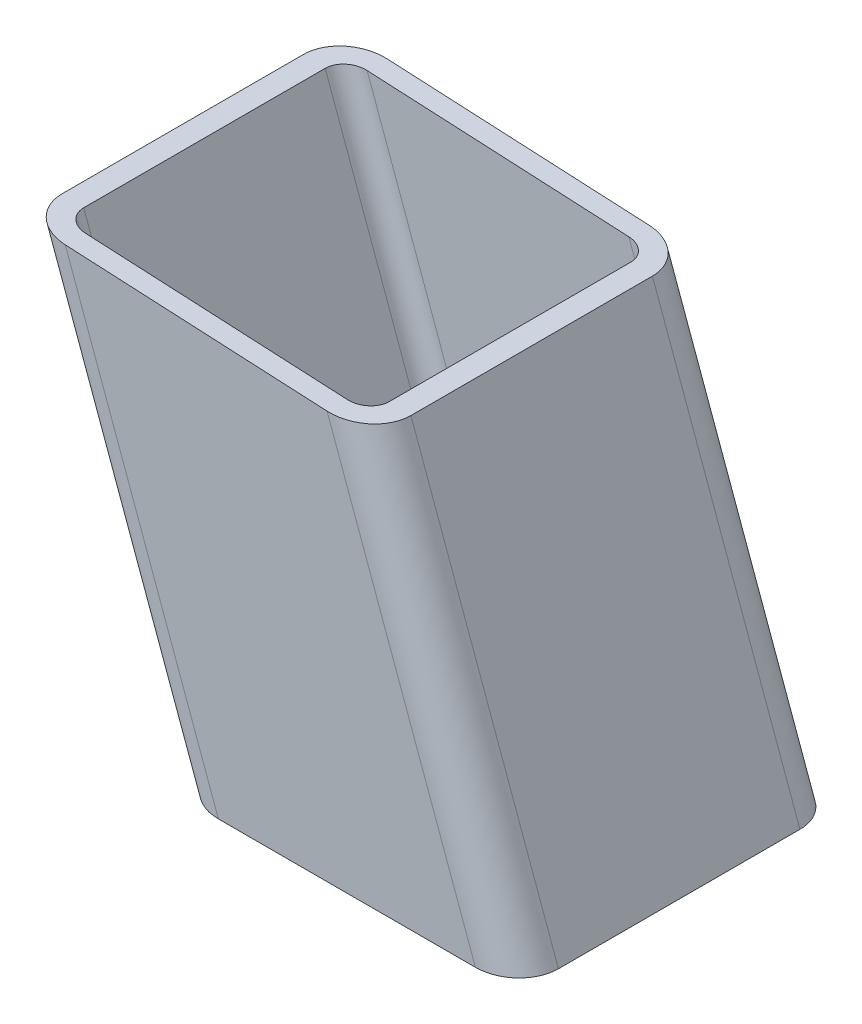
ISO-10303-21;
HEADER;
FILE_DESCRIPTION(('STEP AP214'),'2;1');
FILE_NAME('part.step','',(''),(''),'','','');
FILE_SCHEMA(('AUTOMOTIVE_DESIGN { 1 0 10303 214 1 1 1 1 }'));
ENDSEC;
DATA;
#1=APPLICATION_CONTEXT('core data for automotive mechanical design processes');
#2=APPLICATION_PROTOCOL_DEFINITION('international standard','automotive_design',2000,#1);
#3=PRODUCT_CONTEXT('',#1,'mechanical');
#4=PRODUCT('Part','Part','',(#3));
#5=PRODUCT_RELATED_PRODUCT_CATEGORY('part','',(#4));
#6=PRODUCT_DEFINITION_FORMATION('','',#4);
#7=PRODUCT_DEFINITION_CONTEXT('part definition',#1,'design');
#8=PRODUCT_DEFINITION('design','',#6,#7);
#9=PRODUCT_DEFINITION_SHAPE('','',#8);
#10=(LENGTH_UNIT() NAMED_UNIT(*) SI_UNIT(.MILLI.,.METRE.));
#11=(NAMED_UNIT(*) PLANE_ANGLE_UNIT() SI_UNIT($,.RADIAN.));
#12=(NAMED_UNIT(*) SI_UNIT($,.STERADIAN.) SOLID_ANGLE_UNIT());
#13=UNCERTAINTY_MEASURE_WITH_UNIT(LENGTH_MEASURE(1.E-05),#10,'distance_accuracy_value','');
#14=(GEOMETRIC_REPRESENTATION_CONTEXT(3) GLOBAL_UNCERTAINTY_ASSIGNED_CONTEXT((#13)) GLOBAL_UNIT_ASSIGNED_CONTEXT((#10,
#11,#12)) REPRESENTATION_CONTEXT('',''));
#15=CARTESIAN_POINT('',(0.,0.,0.));
#16=DIRECTION('',(0.,0.,1.));
#17=DIRECTION('',(1.,0.,0.));
#18=AXIS2_PLACEMENT_3D('',#15,#16,#17);
#19=CARTESIAN_POINT('',(4200.10402120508,13.6808057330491,30.));
#20=DIRECTION('',(-0.939692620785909,-0.342020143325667,0.));
#21=DIRECTION('',(0.342020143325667,-0.939692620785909,0.));
#22=AXIS2_PLACEMENT_3D('',#19,#20,#21);
#23=PLANE('',#22);
#24=DIRECTION('',(0.,0.,1.));
#25=VECTOR('',#24,1.);
#26=CARTESIAN_POINT('',(4184.33712391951,56.9999999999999,30.0000000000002));
#27=LINE('',#26,#25);
#28=CARTESIAN_POINT('',(4184.33712391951,57.,-30.));
#29=VERTEX_POINT('',#28);
#30=CARTESIAN_POINT('',(4184.33712391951,56.9999999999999,30.));
#31=VERTEX_POINT('',#30);
#32=EDGE_CURVE('E53',#29,#31,#27,.T.);
#33=ORIENTED_EDGE('',*,*,#32,.F.);
#34=DIRECTION('',(-0.342020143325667,0.939692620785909,0.));
#35=VECTOR('',#34,1.);
#36=CARTESIAN_POINT('',(4200.10402120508,13.6808057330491,-30.));
#37=LINE('',#36,#35);
#38=CARTESIAN_POINT('',(4147.67799517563,157.720128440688,-30.));
#39=VERTEX_POINT('',#38);
#40=EDGE_CURVE('E38',#29,#39,#37,.T.);
#41=ORIENTED_EDGE('',*,*,#40,.T.);
#42=DIRECTION('',(0.,0.,-1.));
#43=VECTOR('',#42,1.);
#44=CARTESIAN_POINT('',(4147.67799517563,157.720128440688,30.));
#45=LINE('',#44,#43);
#46=CARTESIAN_POINT('',(4147.67799517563,157.720128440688,30.));
#47=VERTEX_POINT('',#46);
#48=EDGE_CURVE('E107',#47,#39,#45,.T.);
#49=ORIENTED_EDGE('',*,*,#48,.F.);
#50=DIRECTION('',(-0.342020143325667,0.939692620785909,0.));
#51=VECTOR('',#50,1.);
#52=CARTESIAN_POINT('',(4200.10402120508,13.6808057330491,30.));
#53=LINE('',#52,#51);
#54=EDGE_CURVE('E185',#31,#47,#53,.T.);
#55=ORIENTED_EDGE('',*,*,#54,.F.);
#56=EDGE_LOOP('',(#33,#41,#49,#55));
#57=FACE_BOUND('',#56,.T.);
#58=ADVANCED_FACE('F34',(#57),#23,.F.);
#59=CARTESIAN_POINT('',(4190.70709499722,10.2606042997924,-30.));
#60=DIRECTION('',(-0.342020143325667,0.939692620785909,0.));
#61=DIRECTION('',(-0.939692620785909,-0.342020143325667,0.));
#62=AXIS2_PLACEMENT_3D('',#59,#60,#61);
#63=CYLINDRICAL_SURFACE('',#62,10.);
#64=CARTESIAN_POINT('',(4173.69534619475,57.0000000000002,-30.));
#65=DIRECTION('',(0.,-1.,0.));
#66=DIRECTION('',(-1.,0.,0.));
#67=AXIS2_PLACEMENT_3D('',#64,#65,#66);
#68=ELLIPSE('',#67,10.6417777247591,10.);
#69=CARTESIAN_POINT('',(4173.69534619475,57.0000000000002,-40.));
#70=VERTEX_POINT('',#69);
#71=EDGE_CURVE('E155',#70,#29,#68,.T.);
#72=ORIENTED_EDGE('',*,*,#71,.F.);
#73=DIRECTION('',(-0.342020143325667,0.939692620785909,0.));
#74=VECTOR('',#73,1.);
#75=CARTESIAN_POINT('',(4190.70709499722,10.2606042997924,-40.));
#76=LINE('',#75,#74);
#77=CARTESIAN_POINT('',(4136.83868869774,158.262834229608,-40.));
#78=VERTEX_POINT('',#77);
#79=EDGE_CURVE('E165',#70,#78,#76,.T.);
#80=ORIENTED_EDGE('',*,*,#79,.T.);
#81=CARTESIAN_POINT('',(4136.83868869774,158.262834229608,-30.));
#82=DIRECTION('',(0.0500056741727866,0.998748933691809,0.));
#83=DIRECTION('',(-0.998748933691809,0.0500056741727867,0.));
#84=AXIS2_PLACEMENT_3D('',#81,#82,#83);
#85=ELLIPSE('',#84,10.8528841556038,10.);
#86=EDGE_CURVE('E102',#39,#78,#85,.T.);
#87=ORIENTED_EDGE('',*,*,#86,.F.);
#88=ORIENTED_EDGE('',*,*,#40,.F.);
#89=EDGE_LOOP('',(#72,#80,#87,#88));
#90=FACE_BOUND('',#89,.T.);
#91=ADVANCED_FACE('F164',(#90),#63,.T.);
#92=CARTESIAN_POINT('',(4134.32553775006,-10.2606042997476,-40.));
#93=DIRECTION('',(0.,0.,1.));
#94=DIRECTION('',(1.,0.,0.));
#95=AXIS2_PLACEMENT_3D('',#92,#93,#94);
#96=PLANE('',#95);
#97=DIRECTION('',(1.,0.,0.));
#98=VECTOR('',#97,1.);
#99=CARTESIAN_POINT('',(4134.32553775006,57.0000000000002,-40.));
#100=LINE('',#99,#98);
#101=CARTESIAN_POINT('',(4109.8446798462,57.0000000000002,-40.));
#102=VERTEX_POINT('',#101);
#103=EDGE_CURVE('E152',#102,#70,#100,.T.);
#104=ORIENTED_EDGE('',*,*,#103,.F.);
#105=DIRECTION('',(-0.342020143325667,0.939692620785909,0.));
#106=VECTOR('',#105,1.);
#107=CARTESIAN_POINT('',(4134.32553775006,-10.2606042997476,-40.));
#108=LINE('',#107,#106);
#109=CARTESIAN_POINT('',(4071.8028498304,161.519068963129,-40.));
#110=VERTEX_POINT('',#109);
#111=EDGE_CURVE('E170',#102,#110,#108,.T.);
#112=ORIENTED_EDGE('',*,*,#111,.T.);
#113=DIRECTION('',(-0.998748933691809,0.0500056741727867,0.));
#114=VECTOR('',#113,1.);
#115=CARTESIAN_POINT('',(4142.74840731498,157.966944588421,-40.));
#116=LINE('',#115,#114);
#117=EDGE_CURVE('E169',#78,#110,#116,.T.);
#118=ORIENTED_EDGE('',*,*,#117,.F.);
#119=ORIENTED_EDGE('',*,*,#79,.F.);
#120=EDGE_LOOP('',(#104,#112,#118,#119));
#121=FACE_BOUND('',#120,.T.);
#122=ADVANCED_FACE('F168',(#121),#96,.F.);
#123=CARTESIAN_POINT('',(4134.32553775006,-10.2606042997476,-30.));
#124=DIRECTION('',(-0.342020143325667,0.939692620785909,0.));
#125=DIRECTION('',(-0.939692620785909,-0.342020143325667,0.));
#126=AXIS2_PLACEMENT_3D('',#123,#124,#125);
#127=CYLINDRICAL_SURFACE('',#126,10.);
#128=CARTESIAN_POINT('',(4109.8446798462,57.0000000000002,-30.));
#129=DIRECTION('',(0.,-1.,0.));
#130=DIRECTION('',(-1.,0.,0.));
#131=AXIS2_PLACEMENT_3D('',#128,#129,#130);
#132=ELLIPSE('',#131,10.6417777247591,10.);
#133=CARTESIAN_POINT('',(4099.20290212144,57.0000000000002,-30.));
#134=VERTEX_POINT('',#133);
#135=EDGE_CURVE('E150',#134,#102,#132,.T.);
#136=ORIENTED_EDGE('',*,*,#135,.F.);
#137=DIRECTION('',(-0.342020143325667,0.939692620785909,0.));
#138=VECTOR('',#137,1.);
#139=CARTESIAN_POINT('',(4124.9286115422,-13.6808057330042,-30.));
#140=LINE('',#139,#138);
#141=CARTESIAN_POINT('',(4060.96354335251,162.061774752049,-30.));
#142=VERTEX_POINT('',#141);
#143=EDGE_CURVE('E171',#134,#142,#140,.T.);
#144=ORIENTED_EDGE('',*,*,#143,.T.);
#145=CARTESIAN_POINT('',(4071.8028498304,161.519068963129,-30.));
#146=DIRECTION('',(0.0500056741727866,0.998748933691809,0.));
#147=DIRECTION('',(-0.998748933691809,0.0500056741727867,0.));
#148=AXIS2_PLACEMENT_3D('',#145,#146,#147);
#149=ELLIPSE('',#148,10.8528841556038,10.);
#150=EDGE_CURVE('E228',#110,#142,#149,.T.);
#151=ORIENTED_EDGE('',*,*,#150,.F.);
#152=ORIENTED_EDGE('',*,*,#111,.F.);
#153=EDGE_LOOP('',(#136,#144,#151,#152));
#154=FACE_BOUND('',#153,.T.);
#155=ADVANCED_FACE('F325',(#154),#127,.T.);
#156=CARTESIAN_POINT('',(4124.9286115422,-13.6808057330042,-30.));
#157=DIRECTION('',(0.939692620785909,0.342020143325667,0.));
#158=DIRECTION('',(-0.342020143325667,0.939692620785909,0.));
#159=AXIS2_PLACEMENT_3D('',#156,#157,#158);
#160=PLANE('',#159);
#161=DIRECTION('',(0.,0.,-1.));
#162=VECTOR('',#161,1.);
#163=CARTESIAN_POINT('',(4099.20290212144,57.0000000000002,-29.9999999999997));
#164=LINE('',#163,#162);
#165=CARTESIAN_POINT('',(4099.20290212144,56.9999999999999,30.));
#166=VERTEX_POINT('',#165);
#167=EDGE_CURVE('E253',#166,#134,#164,.T.);
#168=ORIENTED_EDGE('',*,*,#167,.F.);
#169=DIRECTION('',(-0.342020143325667,0.939692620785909,0.));
#170=VECTOR('',#169,1.);
#171=CARTESIAN_POINT('',(4124.9286115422,-13.6808057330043,30.));
#172=LINE('',#171,#170);
#173=CARTESIAN_POINT('',(4060.96354335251,162.061774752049,30.));
#174=VERTEX_POINT('',#173);
#175=EDGE_CURVE('E176',#166,#174,#172,.T.);
#176=ORIENTED_EDGE('',*,*,#175,.T.);
#177=DIRECTION('',(0.,0.,1.));
#178=VECTOR('',#177,1.);
#179=CARTESIAN_POINT('',(4060.96354335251,162.061774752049,-30.0000000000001));
#180=LINE('',#179,#178);
#181=EDGE_CURVE('E230',#142,#174,#180,.T.);
#182=ORIENTED_EDGE('',*,*,#181,.F.);
#183=ORIENTED_EDGE('',*,*,#143,.F.);
#184=EDGE_LOOP('',(#168,#176,#182,#183));
#185=FACE_BOUND('',#184,.T.);
#186=ADVANCED_FACE('F328',(#185),#160,.F.);
#187=CARTESIAN_POINT('',(4134.32553775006,-10.2606042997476,30.));
#188=DIRECTION('',(-0.342020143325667,0.939692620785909,0.));
#189=DIRECTION('',(-0.939692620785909,-0.342020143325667,0.));
#190=AXIS2_PLACEMENT_3D('',#187,#188,#189);
#191=CYLINDRICAL_SURFACE('',#190,10.);
#192=CARTESIAN_POINT('',(4109.8446798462,56.9999999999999,30.));
#193=DIRECTION('',(0.,-1.,0.));
#194=DIRECTION('',(-1.,0.,0.));
#195=AXIS2_PLACEMENT_3D('',#192,#193,#194);
#196=ELLIPSE('',#195,10.6417777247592,10.);
#197=CARTESIAN_POINT('',(4109.8446798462,56.9999999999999,40.));
#198=VERTEX_POINT('',#197);
#199=EDGE_CURVE('E255',#198,#166,#196,.T.);
#200=ORIENTED_EDGE('',*,*,#199,.F.);
#201=DIRECTION('',(-0.342020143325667,0.939692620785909,0.));
#202=VECTOR('',#201,1.);
#203=CARTESIAN_POINT('',(4134.32553775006,-10.2606042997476,40.));
#204=LINE('',#203,#202);
#205=CARTESIAN_POINT('',(4071.8028498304,161.519068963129,40.));
#206=VERTEX_POINT('',#205);
#207=EDGE_CURVE('E179',#198,#206,#204,.T.);
#208=ORIENTED_EDGE('',*,*,#207,.T.);
#209=CARTESIAN_POINT('',(4071.8028498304,161.519068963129,30.));
#210=DIRECTION('',(0.0500056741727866,0.998748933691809,0.));
#211=DIRECTION('',(-0.998748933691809,0.0500056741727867,0.));
#212=AXIS2_PLACEMENT_3D('',#209,#210,#211);
#213=ELLIPSE('',#212,10.8528841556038,10.);
#214=EDGE_CURVE('E232',#174,#206,#213,.T.);
#215=ORIENTED_EDGE('',*,*,#214,.F.);
#216=ORIENTED_EDGE('',*,*,#175,.F.);
#217=EDGE_LOOP('',(#200,#208,#215,#216));
#218=FACE_BOUND('',#217,.T.);
#219=ADVANCED_FACE('F332',(#218),#191,.T.);
#220=CARTESIAN_POINT('',(4190.70709499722,10.2606042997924,40.));
#221=DIRECTION('',(0.,0.,-1.));
#222=DIRECTION('',(-1.,0.,0.));
#223=AXIS2_PLACEMENT_3D('',#220,#221,#222);
#224=PLANE('',#223);
#225=DIRECTION('',(-1.,0.,0.));
#226=VECTOR('',#225,1.);
#227=CARTESIAN_POINT('',(4190.70709499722,56.9999999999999,40.));
#228=LINE('',#227,#226);
#229=CARTESIAN_POINT('',(4173.69534619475,56.9999999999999,40.));
#230=VERTEX_POINT('',#229);
#231=EDGE_CURVE('E257',#230,#198,#228,.T.);
#232=ORIENTED_EDGE('',*,*,#231,.F.);
#233=DIRECTION('',(-0.342020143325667,0.939692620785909,0.));
#234=VECTOR('',#233,1.);
#235=CARTESIAN_POINT('',(4190.70709499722,10.2606042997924,40.));
#236=LINE('',#235,#234);
#237=CARTESIAN_POINT('',(4136.83868869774,158.262834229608,40.));
#238=VERTEX_POINT('',#237);
#239=EDGE_CURVE('E182',#230,#238,#236,.T.);
#240=ORIENTED_EDGE('',*,*,#239,.T.);
#241=DIRECTION('',(0.998748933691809,-0.0500056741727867,0.));
#242=VECTOR('',#241,1.);
#243=CARTESIAN_POINT('',(4197.96408561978,155.202388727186,40.));
#244=LINE('',#243,#242);
#245=EDGE_CURVE('E234',#206,#238,#244,.T.);
#246=ORIENTED_EDGE('',*,*,#245,.F.);
#247=ORIENTED_EDGE('',*,*,#207,.F.);
#248=EDGE_LOOP('',(#232,#240,#246,#247));
#249=FACE_BOUND('',#248,.T.);
#250=ADVANCED_FACE('F335',(#249),#224,.F.);
#251=CARTESIAN_POINT('',(4190.70709499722,10.2606042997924,30.));
#252=DIRECTION('',(-0.342020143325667,0.939692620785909,0.));
#253=DIRECTION('',(-0.939692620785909,-0.342020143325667,0.));
#254=AXIS2_PLACEMENT_3D('',#251,#252,#253);
#255=CYLINDRICAL_SURFACE('',#254,10.);
#256=CARTESIAN_POINT('',(4173.69534619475,56.9999999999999,30.));
#257=DIRECTION('',(0.,-1.,0.));
#258=DIRECTION('',(-1.,0.,0.));
#259=AXIS2_PLACEMENT_3D('',#256,#257,#258);
#260=ELLIPSE('',#259,10.6417777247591,10.);
#261=EDGE_CURVE('E236',#31,#230,#260,.T.);
#262=ORIENTED_EDGE('',*,*,#261,.F.);
#263=ORIENTED_EDGE('',*,*,#54,.T.);
#264=CARTESIAN_POINT('',(4136.83868869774,158.262834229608,30.));
#265=DIRECTION('',(0.0500056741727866,0.998748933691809,0.));
#266=DIRECTION('',(-0.998748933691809,0.0500056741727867,0.));
#267=AXIS2_PLACEMENT_3D('',#264,#265,#266);
#268=ELLIPSE('',#267,10.8528841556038,10.);
#269=EDGE_CURVE('E110',#238,#47,#268,.T.);
#270=ORIENTED_EDGE('',*,*,#269,.F.);
#271=ORIENTED_EDGE('',*,*,#239,.F.);
#272=EDGE_LOOP('',(#262,#263,#270,#271));
#273=FACE_BOUND('',#272,.T.);
#274=ADVANCED_FACE('F36',(#273),#255,.T.);
#275=CARTESIAN_POINT('',(6158.08276398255,57.0625533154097,-40.));
#276=DIRECTION('',(0.0500056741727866,0.998748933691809,0.));
#277=DIRECTION('',(-0.998748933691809,0.0500056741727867,0.));
#278=AXIS2_PLACEMENT_3D('',#275,#276,#277);
#279=PLANE('',#278);
#280=DIRECTION('',(0.,0.,1.));
#281=VECTOR('',#280,1.);
#282=CARTESIAN_POINT('',(4066.38319659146,161.790421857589,-30.));
#283=LINE('',#282,#281);
#284=CARTESIAN_POINT('',(4066.38319659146,161.790421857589,-30.));
#285=VERTEX_POINT('',#284);
#286=CARTESIAN_POINT('',(4066.38319659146,161.790421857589,30.));
#287=VERTEX_POINT('',#286);
#288=EDGE_CURVE('E191',#285,#287,#283,.T.);
#289=ORIENTED_EDGE('',*,*,#288,.F.);
#290=CARTESIAN_POINT('',(4071.8028498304,161.519068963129,-30.));
#291=DIRECTION('',(0.0500056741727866,0.998748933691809,0.));
#292=DIRECTION('',(-0.998748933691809,0.0500056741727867,0.));
#293=AXIS2_PLACEMENT_3D('',#290,#291,#292);
#294=ELLIPSE('',#293,5.4264420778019,5.00000000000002);
#295=CARTESIAN_POINT('',(4071.8028498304,161.519068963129,-35.));
#296=VERTEX_POINT('',#295);
#297=EDGE_CURVE('E196',#296,#285,#294,.T.);
#298=ORIENTED_EDGE('',*,*,#297,.F.);
#299=DIRECTION('',(-0.998748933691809,0.0500056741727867,0.));
#300=VECTOR('',#299,1.);
#301=CARTESIAN_POINT('',(4142.74840731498,157.966944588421,-35.));
#302=LINE('',#301,#300);
#303=CARTESIAN_POINT('',(4136.83868869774,158.262834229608,-35.));
#304=VERTEX_POINT('',#303);
#305=EDGE_CURVE('E201',#304,#296,#302,.T.);
#306=ORIENTED_EDGE('',*,*,#305,.F.);
#307=CARTESIAN_POINT('',(4136.83868869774,158.262834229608,-30.));
#308=DIRECTION('',(0.0500056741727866,0.998748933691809,0.));
#309=DIRECTION('',(-0.998748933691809,0.0500056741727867,0.));
#310=AXIS2_PLACEMENT_3D('',#307,#308,#309);
#311=ELLIPSE('',#310,5.4264420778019,5.00000000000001);
#312=CARTESIAN_POINT('',(4142.25834193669,157.991481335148,-30.));
#313=VERTEX_POINT('',#312);
#314=EDGE_CURVE('E206',#313,#304,#311,.T.);
#315=ORIENTED_EDGE('',*,*,#314,.F.);
#316=DIRECTION('',(0.,0.,-1.));
#317=VECTOR('',#316,1.);
#318=CARTESIAN_POINT('',(4142.25834193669,157.991481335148,30.));
#319=LINE('',#318,#317);
#320=CARTESIAN_POINT('',(4142.25834193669,157.991481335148,30.));
#321=VERTEX_POINT('',#320);
#322=EDGE_CURVE('E211',#321,#313,#319,.T.);
#323=ORIENTED_EDGE('',*,*,#322,.F.);
#324=CARTESIAN_POINT('',(4136.83868869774,158.262834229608,30.));
#325=DIRECTION('',(0.0500056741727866,0.998748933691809,0.));
#326=DIRECTION('',(-0.998748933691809,0.0500056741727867,0.));
#327=AXIS2_PLACEMENT_3D('',#324,#325,#326);
#328=ELLIPSE('',#327,5.4264420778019,5.00000000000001);
#329=CARTESIAN_POINT('',(4136.83868869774,158.262834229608,35.));
#330=VERTEX_POINT('',#329);
#331=EDGE_CURVE('E216',#330,#321,#328,.T.);
#332=ORIENTED_EDGE('',*,*,#331,.F.);
#333=DIRECTION('',(0.998748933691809,-0.0500056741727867,0.));
#334=VECTOR('',#333,1.);
#335=CARTESIAN_POINT('',(4197.96408561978,155.202388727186,35.));
#336=LINE('',#335,#334);
#337=CARTESIAN_POINT('',(4071.8028498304,161.519068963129,35.));
#338=VERTEX_POINT('',#337);
#339=EDGE_CURVE('E221',#338,#330,#336,.T.);
#340=ORIENTED_EDGE('',*,*,#339,.F.);
#341=CARTESIAN_POINT('',(4071.8028498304,161.519068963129,30.));
#342=DIRECTION('',(0.0500056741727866,0.998748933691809,0.));
#343=DIRECTION('',(-0.998748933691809,0.0500056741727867,0.));
#344=AXIS2_PLACEMENT_3D('',#341,#342,#343);
#345=ELLIPSE('',#344,5.42644207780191,5.00000000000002);
#346=EDGE_CURVE('E11',#287,#338,#345,.T.);
#347=ORIENTED_EDGE('',*,*,#346,.F.);
#348=EDGE_LOOP('',(#289,#298,#306,#315,#323,#332,#340,#347));
#349=FACE_BOUND('',#348,.T.);
#350=ORIENTED_EDGE('',*,*,#269,.T.);
#351=ORIENTED_EDGE('',*,*,#48,.T.);
#352=ORIENTED_EDGE('',*,*,#86,.T.);
#353=ORIENTED_EDGE('',*,*,#117,.T.);
#354=ORIENTED_EDGE('',*,*,#150,.T.);
#355=ORIENTED_EDGE('',*,*,#181,.T.);
#356=ORIENTED_EDGE('',*,*,#214,.T.);
#357=ORIENTED_EDGE('',*,*,#245,.T.);
#358=EDGE_LOOP('',(#350,#351,#352,#353,#354,#355,#356,#357));
#359=FACE_BOUND('',#358,.T.);
#360=ADVANCED_FACE('F286',(#349,#359),#279,.T.);
#361=CARTESIAN_POINT('',(9149.96897120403,57.0000000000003,-59.9999999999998));
#362=DIRECTION('',(0.,-1.,0.));
#363=DIRECTION('',(0.,0.,-1.));
#364=AXIS2_PLACEMENT_3D('',#361,#362,#363);
#365=PLANE('',#364);
#366=DIRECTION('',(-1.,0.,0.));
#367=VECTOR('',#366,1.);
#368=CARTESIAN_POINT('',(4190.70709499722,56.9999999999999,35.));
#369=LINE('',#368,#367);
#370=CARTESIAN_POINT('',(4173.69534619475,56.9999999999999,35.));
#371=VERTEX_POINT('',#370);
#372=CARTESIAN_POINT('',(4109.8446798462,56.9999999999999,35.));
#373=VERTEX_POINT('',#372);
#374=EDGE_CURVE('E222',#371,#373,#369,.T.);
#375=ORIENTED_EDGE('',*,*,#374,.F.);
#376=CARTESIAN_POINT('',(4173.69534619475,56.9999999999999,30.));
#377=DIRECTION('',(0.,-1.,0.));
#378=DIRECTION('',(-1.,0.,0.));
#379=AXIS2_PLACEMENT_3D('',#376,#377,#378);
#380=ELLIPSE('',#379,5.32088886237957,5.00000000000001);
#381=CARTESIAN_POINT('',(4179.01623505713,56.9999999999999,30.));
#382=VERTEX_POINT('',#381);
#383=EDGE_CURVE('E217',#382,#371,#380,.T.);
#384=ORIENTED_EDGE('',*,*,#383,.F.);
#385=DIRECTION('',(0.,0.,1.));
#386=VECTOR('',#385,1.);
#387=CARTESIAN_POINT('',(4179.01623505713,56.9999999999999,30.0000000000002));
#388=LINE('',#387,#386);
#389=CARTESIAN_POINT('',(4179.01623505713,57.0000000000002,-30.));
#390=VERTEX_POINT('',#389);
#391=EDGE_CURVE('E212',#390,#382,#388,.T.);
#392=ORIENTED_EDGE('',*,*,#391,.F.);
#393=CARTESIAN_POINT('',(4173.69534619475,57.0000000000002,-30.));
#394=DIRECTION('',(0.,-1.,0.));
#395=DIRECTION('',(-1.,0.,0.));
#396=AXIS2_PLACEMENT_3D('',#393,#394,#395);
#397=ELLIPSE('',#396,5.32088886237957,5.00000000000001);
#398=CARTESIAN_POINT('',(4173.69534619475,57.0000000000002,-35.));
#399=VERTEX_POINT('',#398);
#400=EDGE_CURVE('E207',#399,#390,#397,.T.);
#401=ORIENTED_EDGE('',*,*,#400,.F.);
#402=DIRECTION('',(1.,0.,0.));
#403=VECTOR('',#402,1.);
#404=CARTESIAN_POINT('',(4134.32553775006,57.0000000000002,-35.));
#405=LINE('',#404,#403);
#406=CARTESIAN_POINT('',(4109.8446798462,57.0000000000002,-35.));
#407=VERTEX_POINT('',#406);
#408=EDGE_CURVE('E202',#407,#399,#405,.T.);
#409=ORIENTED_EDGE('',*,*,#408,.F.);
#410=CARTESIAN_POINT('',(4109.8446798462,57.0000000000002,-30.));
#411=DIRECTION('',(0.,-1.,0.));
#412=DIRECTION('',(-1.,0.,0.));
#413=AXIS2_PLACEMENT_3D('',#410,#411,#412);
#414=ELLIPSE('',#413,5.32088886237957,5.00000000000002);
#415=CARTESIAN_POINT('',(4104.52379098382,57.0000000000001,-30.));
#416=VERTEX_POINT('',#415);
#417=EDGE_CURVE('E197',#416,#407,#414,.T.);
#418=ORIENTED_EDGE('',*,*,#417,.F.);
#419=DIRECTION('',(0.,0.,-1.));
#420=VECTOR('',#419,1.);
#421=CARTESIAN_POINT('',(4104.52379098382,57.0000000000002,-29.9999999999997));
#422=LINE('',#421,#420);
#423=CARTESIAN_POINT('',(4104.52379098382,56.9999999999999,30.));
#424=VERTEX_POINT('',#423);
#425=EDGE_CURVE('E192',#424,#416,#422,.T.);
#426=ORIENTED_EDGE('',*,*,#425,.F.);
#427=CARTESIAN_POINT('',(4109.8446798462,56.9999999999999,30.));
#428=DIRECTION('',(0.,-1.,0.));
#429=DIRECTION('',(-1.,0.,0.));
#430=AXIS2_PLACEMENT_3D('',#427,#428,#429);
#431=ELLIPSE('',#430,5.32088886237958,5.00000000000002);
#432=EDGE_CURVE('E225',#373,#424,#431,.T.);
#433=ORIENTED_EDGE('',*,*,#432,.F.);
#434=EDGE_LOOP('',(#375,#384,#392,#401,#409,#418,#426,#433));
#435=FACE_BOUND('',#434,.T.);
#436=ORIENTED_EDGE('',*,*,#261,.T.);
#437=ORIENTED_EDGE('',*,*,#231,.T.);
#438=ORIENTED_EDGE('',*,*,#199,.T.);
#439=ORIENTED_EDGE('',*,*,#167,.T.);
#440=ORIENTED_EDGE('',*,*,#135,.T.);
#441=ORIENTED_EDGE('',*,*,#103,.T.);
#442=ORIENTED_EDGE('',*,*,#71,.T.);
#443=ORIENTED_EDGE('',*,*,#32,.T.);
#444=EDGE_LOOP('',(#436,#437,#438,#439,#440,#441,#442,#443));
#445=FACE_BOUND('',#444,.T.);
#446=ADVANCED_FACE('F154',(#435,#445),#365,.T.);
#447=CARTESIAN_POINT('',(4129.62707464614,-11.9707050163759,-30.));
#448=DIRECTION('',(0.939692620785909,0.342020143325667,0.));
#449=DIRECTION('',(-0.342020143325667,0.939692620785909,0.));
#450=AXIS2_PLACEMENT_3D('',#447,#448,#449);
#451=PLANE('',#450);
#452=DIRECTION('',(-0.342020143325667,0.939692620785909,0.));
#453=VECTOR('',#452,1.);
#454=CARTESIAN_POINT('',(4129.62707464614,-11.9707050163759,30.));
#455=LINE('',#454,#453);
#456=EDGE_CURVE('E44',#424,#287,#455,.T.);
#457=ORIENTED_EDGE('',*,*,#456,.F.);
#458=ORIENTED_EDGE('',*,*,#425,.T.);
#459=DIRECTION('',(-0.342020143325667,0.939692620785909,0.));
#460=VECTOR('',#459,1.);
#461=CARTESIAN_POINT('',(4129.62707464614,-11.9707050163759,-30.));
#462=LINE('',#461,#460);
#463=EDGE_CURVE('E188',#416,#285,#462,.T.);
#464=ORIENTED_EDGE('',*,*,#463,.T.);
#465=ORIENTED_EDGE('',*,*,#288,.T.);
#466=EDGE_LOOP('',(#457,#458,#464,#465));
#467=FACE_BOUND('',#466,.T.);
#468=ADVANCED_FACE('F283',(#467),#451,.T.);
#469=CARTESIAN_POINT('',(4134.32553775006,-10.2606042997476,-30.));
#470=DIRECTION('',(-0.342020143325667,0.939692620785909,0.));
#471=DIRECTION('',(-0.939692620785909,-0.342020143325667,0.));
#472=AXIS2_PLACEMENT_3D('',#469,#470,#471);
#473=CYLINDRICAL_SURFACE('',#472,5.00000000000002);
#474=ORIENTED_EDGE('',*,*,#463,.F.);
#475=ORIENTED_EDGE('',*,*,#417,.T.);
#476=DIRECTION('',(-0.342020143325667,0.939692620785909,0.));
#477=VECTOR('',#476,1.);
#478=CARTESIAN_POINT('',(4134.32553775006,-10.2606042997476,-35.));
#479=LINE('',#478,#477);
#480=EDGE_CURVE('E193',#407,#296,#479,.T.);
#481=ORIENTED_EDGE('',*,*,#480,.T.);
#482=ORIENTED_EDGE('',*,*,#297,.T.);
#483=EDGE_LOOP('',(#474,#475,#481,#482));
#484=FACE_BOUND('',#483,.T.);
#485=ADVANCED_FACE('F288',(#484),#473,.F.);
#486=CARTESIAN_POINT('',(4134.32553775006,-10.2606042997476,-35.));
#487=DIRECTION('',(0.,0.,1.));
#488=DIRECTION('',(1.,0.,0.));
#489=AXIS2_PLACEMENT_3D('',#486,#487,#488);
#490=PLANE('',#489);
#491=ORIENTED_EDGE('',*,*,#480,.F.);
#492=ORIENTED_EDGE('',*,*,#408,.T.);
#493=DIRECTION('',(-0.342020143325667,0.939692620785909,0.));
#494=VECTOR('',#493,1.);
#495=CARTESIAN_POINT('',(4190.70709499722,10.2606042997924,-35.));
#496=LINE('',#495,#494);
#497=EDGE_CURVE('E198',#399,#304,#496,.T.);
#498=ORIENTED_EDGE('',*,*,#497,.T.);
#499=ORIENTED_EDGE('',*,*,#305,.T.);
#500=EDGE_LOOP('',(#491,#492,#498,#499));
#501=FACE_BOUND('',#500,.T.);
#502=ADVANCED_FACE('F292',(#501),#490,.T.);
#503=CARTESIAN_POINT('',(4190.70709499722,10.2606042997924,-30.));
#504=DIRECTION('',(-0.342020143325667,0.939692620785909,0.));
#505=DIRECTION('',(-0.939692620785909,-0.342020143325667,0.));
#506=AXIS2_PLACEMENT_3D('',#503,#504,#505);
#507=CYLINDRICAL_SURFACE('',#506,5.00000000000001);
#508=ORIENTED_EDGE('',*,*,#497,.F.);
#509=ORIENTED_EDGE('',*,*,#400,.T.);
#510=DIRECTION('',(-0.342020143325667,0.939692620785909,0.));
#511=VECTOR('',#510,1.);
#512=CARTESIAN_POINT('',(4195.40555810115,11.9707050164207,-30.));
#513=LINE('',#512,#511);
#514=EDGE_CURVE('E203',#390,#313,#513,.T.);
#515=ORIENTED_EDGE('',*,*,#514,.T.);
#516=ORIENTED_EDGE('',*,*,#314,.T.);
#517=EDGE_LOOP('',(#508,#509,#515,#516));
#518=FACE_BOUND('',#517,.T.);
#519=ADVANCED_FACE('F295',(#518),#507,.F.);
#520=CARTESIAN_POINT('',(4195.40555810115,11.9707050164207,30.));
#521=DIRECTION('',(-0.939692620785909,-0.342020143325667,0.));
#522=DIRECTION('',(0.342020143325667,-0.939692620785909,0.));
#523=AXIS2_PLACEMENT_3D('',#520,#521,#522);
#524=PLANE('',#523);
#525=ORIENTED_EDGE('',*,*,#514,.F.);
#526=ORIENTED_EDGE('',*,*,#391,.T.);
#527=DIRECTION('',(-0.342020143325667,0.939692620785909,0.));
#528=VECTOR('',#527,1.);
#529=CARTESIAN_POINT('',(4195.40555810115,11.9707050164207,30.));
#530=LINE('',#529,#528);
#531=EDGE_CURVE('E208',#382,#321,#530,.T.);
#532=ORIENTED_EDGE('',*,*,#531,.T.);
#533=ORIENTED_EDGE('',*,*,#322,.T.);
#534=EDGE_LOOP('',(#525,#526,#532,#533));
#535=FACE_BOUND('',#534,.T.);
#536=ADVANCED_FACE('F298',(#535),#524,.T.);
#537=CARTESIAN_POINT('',(4190.70709499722,10.2606042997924,30.));
#538=DIRECTION('',(-0.342020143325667,0.939692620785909,0.));
#539=DIRECTION('',(-0.939692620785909,-0.342020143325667,0.));
#540=AXIS2_PLACEMENT_3D('',#537,#538,#539);
#541=CYLINDRICAL_SURFACE('',#540,5.00000000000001);
#542=ORIENTED_EDGE('',*,*,#531,.F.);
#543=ORIENTED_EDGE('',*,*,#383,.T.);
#544=DIRECTION('',(-0.342020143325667,0.939692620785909,0.));
#545=VECTOR('',#544,1.);
#546=CARTESIAN_POINT('',(4190.70709499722,10.2606042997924,35.));
#547=LINE('',#546,#545);
#548=EDGE_CURVE('E213',#371,#330,#547,.T.);
#549=ORIENTED_EDGE('',*,*,#548,.T.);
#550=ORIENTED_EDGE('',*,*,#331,.T.);
#551=EDGE_LOOP('',(#542,#543,#549,#550));
#552=FACE_BOUND('',#551,.T.);
#553=ADVANCED_FACE('F301',(#552),#541,.F.);
#554=CARTESIAN_POINT('',(4190.70709499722,10.2606042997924,35.));
#555=DIRECTION('',(0.,0.,-1.));
#556=DIRECTION('',(-1.,0.,0.));
#557=AXIS2_PLACEMENT_3D('',#554,#555,#556);
#558=PLANE('',#557);
#559=ORIENTED_EDGE('',*,*,#548,.F.);
#560=ORIENTED_EDGE('',*,*,#374,.T.);
#561=DIRECTION('',(-0.342020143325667,0.939692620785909,0.));
#562=VECTOR('',#561,1.);
#563=CARTESIAN_POINT('',(4134.32553775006,-10.2606042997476,35.));
#564=LINE('',#563,#562);
#565=EDGE_CURVE('E218',#373,#338,#564,.T.);
#566=ORIENTED_EDGE('',*,*,#565,.T.);
#567=ORIENTED_EDGE('',*,*,#339,.T.);
#568=EDGE_LOOP('',(#559,#560,#566,#567));
#569=FACE_BOUND('',#568,.T.);
#570=ADVANCED_FACE('F304',(#569),#558,.T.);
#571=CARTESIAN_POINT('',(4134.32553775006,-10.2606042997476,30.));
#572=DIRECTION('',(-0.342020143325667,0.939692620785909,0.));
#573=DIRECTION('',(-0.939692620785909,-0.342020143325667,0.));
#574=AXIS2_PLACEMENT_3D('',#571,#572,#573);
#575=CYLINDRICAL_SURFACE('',#574,5.00000000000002);
#576=ORIENTED_EDGE('',*,*,#565,.F.);
#577=ORIENTED_EDGE('',*,*,#432,.T.);
#578=ORIENTED_EDGE('',*,*,#456,.T.);
#579=ORIENTED_EDGE('',*,*,#346,.T.);
#580=EDGE_LOOP('',(#576,#577,#578,#579));
#581=FACE_BOUND('',#580,.T.);
#582=ADVANCED_FACE('F280',(#581),#575,.F.);
#583=CLOSED_SHELL('',(#58,#91,#122,#155,#186,#219,#250,#274,#360,#446,#468,#485,#502,#519,#536,
#553,#570,#582));
#584=MANIFOLD_SOLID_BREP('B2',#583);
#585=ADVANCED_BREP_SHAPE_REPRESENTATION('',(#18,#584),#14);
#586=SHAPE_DEFINITION_REPRESENTATION(#9,#585);
ENDSEC;
END-ISO-10303-21;
